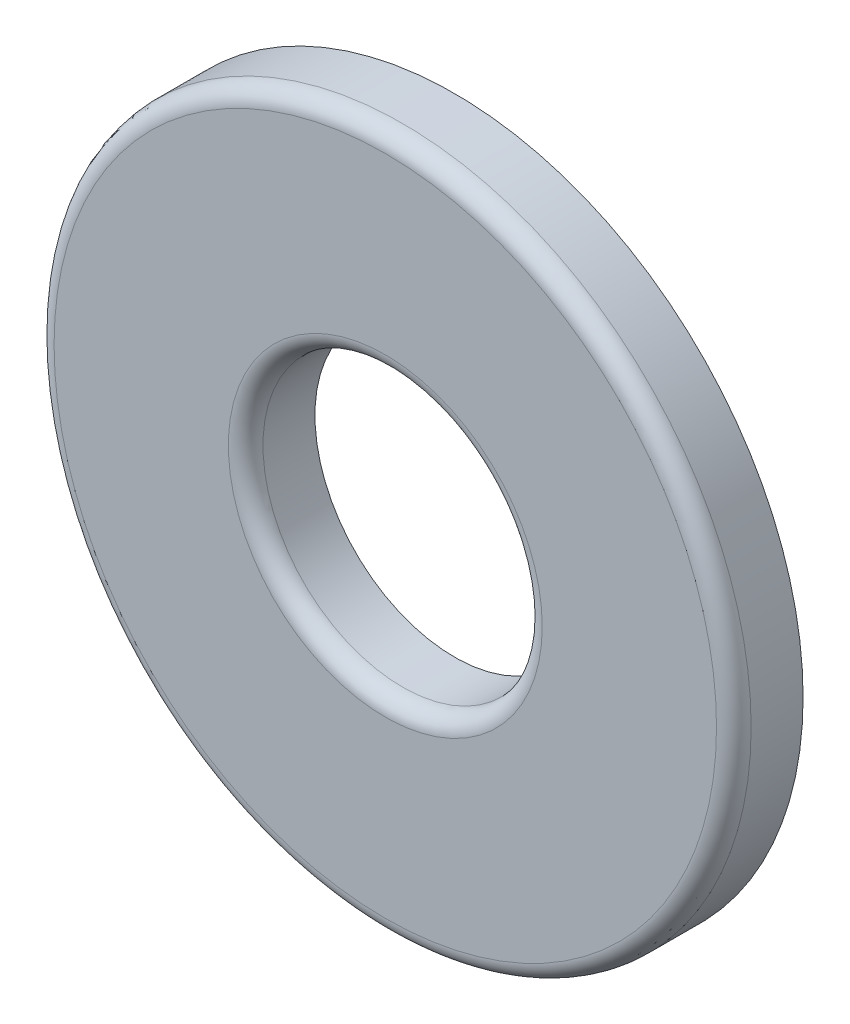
from build123d import *

# Parameters (mm, degrees)
BOSS_EXTRUDE1_DEPTH      = 0.3937
BOSS_EXTRUDE1_DEPTH_BACK = 0.3937
SKETCH3_R                = 3.9624
SKETCH3_R_2              = 1.5875
FILLET1_R                = 0.19685


with BuildPart() as part:
    # Sketch3 → Boss-Extrude1 (new, two sides: drawn at the far end of the back side and taken through both)
    with BuildSketch(Plane.XY.offset(-BOSS_EXTRUDE1_DEPTH_BACK)):
        Circle(SKETCH3_R)
        Circle(SKETCH3_R_2, mode=Mode.SUBTRACT)
    extrude(amount=BOSS_EXTRUDE1_DEPTH + BOSS_EXTRUDE1_DEPTH_BACK)

    # Fillet1
    fillet1_edges = [part.edges().sort_by_distance(p)[0] for p in [
        (-3.9624, 0, 0.3937),
        (-1.5875, 0, 0.3937),
    ]]
    fillet(fillet1_edges, radius=FILLET1_R)


solid = part.part
